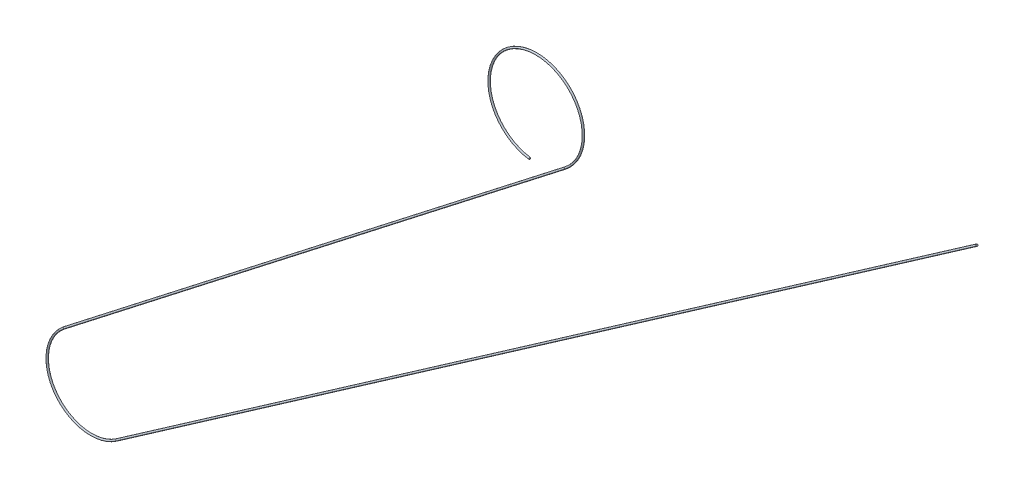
ISO-10303-21;
HEADER;
FILE_DESCRIPTION(('STEP AP214'),'2;1');
FILE_NAME('part.step','',(''),(''),'','','');
FILE_SCHEMA(('AUTOMOTIVE_DESIGN { 1 0 10303 214 1 1 1 1 }'));
ENDSEC;
DATA;
#1=APPLICATION_CONTEXT('core data for automotive mechanical design processes');
#2=APPLICATION_PROTOCOL_DEFINITION('international standard','automotive_design',2000,#1);
#3=PRODUCT_CONTEXT('',#1,'mechanical');
#4=PRODUCT('Part','Part','',(#3));
#5=PRODUCT_RELATED_PRODUCT_CATEGORY('part','',(#4));
#6=PRODUCT_DEFINITION_FORMATION('','',#4);
#7=PRODUCT_DEFINITION_CONTEXT('part definition',#1,'design');
#8=PRODUCT_DEFINITION('design','',#6,#7);
#9=PRODUCT_DEFINITION_SHAPE('','',#8);
#10=(LENGTH_UNIT() NAMED_UNIT(*) SI_UNIT(.MILLI.,.METRE.));
#11=(NAMED_UNIT(*) PLANE_ANGLE_UNIT() SI_UNIT($,.RADIAN.));
#12=(NAMED_UNIT(*) SI_UNIT($,.STERADIAN.) SOLID_ANGLE_UNIT());
#13=UNCERTAINTY_MEASURE_WITH_UNIT(LENGTH_MEASURE(1.E-05),#10,'distance_accuracy_value','');
#14=(GEOMETRIC_REPRESENTATION_CONTEXT(3) GLOBAL_UNCERTAINTY_ASSIGNED_CONTEXT((#13)) GLOBAL_UNIT_ASSIGNED_CONTEXT((#10,
#11,#12)) REPRESENTATION_CONTEXT('',''));
#15=CARTESIAN_POINT('',(0.,0.,0.));
#16=DIRECTION('',(0.,0.,1.));
#17=DIRECTION('',(1.,0.,0.));
#18=AXIS2_PLACEMENT_3D('',#15,#16,#17);
#19=CARTESIAN_POINT('',(-1249.96317616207,-288.929952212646,0.));
#20=DIRECTION('',(0.,0.,1.));
#21=DIRECTION('',(1.,0.,0.));
#22=AXIS2_PLACEMENT_3D('',#19,#20,#21);
#23=TOROIDAL_SURFACE('',#22,133.8,2.5);
#24=CARTESIAN_POINT('',(-1167.91298345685,-394.619146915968,0.));
#25=DIRECTION('',(-0.78990429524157,-0.61323013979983,0.));
#26=DIRECTION('',(0.61323013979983,-0.78990429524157,0.));
#27=AXIS2_PLACEMENT_3D('',#24,#25,#26);
#28=CIRCLE('',#27,2.5);
#29=CARTESIAN_POINT('',(-1166.37990810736,-396.593907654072,0.));
#30=VERTEX_POINT('',#29);
#31=EDGE_CURVE('E39',#30,#30,#28,.T.);
#32=CARTESIAN_POINT('',(-1268.45419749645,-421.446072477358,0.));
#33=DIRECTION('',(-0.990404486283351,0.138198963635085,0.));
#34=DIRECTION('',(-0.138198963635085,-0.990404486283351,0.));
#35=AXIS2_PLACEMENT_3D('',#32,#33,#34);
#36=CIRCLE('',#35,2.5);
#37=CARTESIAN_POINT('',(-1268.79969490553,-423.922083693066,0.));
#38=VERTEX_POINT('',#37);
#39=EDGE_CURVE('E10',#38,#38,#36,.T.);
#40=CARTESIAN_POINT('',(-1249.96317616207,-288.929952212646,0.));
#41=DIRECTION('',(0.,0.,1.));
#42=DIRECTION('',(1.,0.,0.));
#43=AXIS2_PLACEMENT_3D('',#40,#41,#42);
#44=CIRCLE('',#43,136.3);
#45=EDGE_CURVE('',#30,#38,#44,.T.);
#46=ORIENTED_EDGE('',*,*,#31,.F.);
#47=ORIENTED_EDGE('',*,*,#39,.T.);
#48=ORIENTED_EDGE('',*,*,#45,.T.);
#49=ORIENTED_EDGE('',*,*,#45,.F.);
#50=EDGE_LOOP('',(#46,#48,#47,#49));
#51=FACE_BOUND('',#50,.T.);
#52=ADVANCED_FACE('F33',(#51),#23,.T.);
#53=CARTESIAN_POINT('',(-2588.86674291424,-1497.75490375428,0.));
#54=DIRECTION('',(0.789904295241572,0.613230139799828,0.));
#55=DIRECTION('',(-0.613230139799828,0.789904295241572,0.));
#56=AXIS2_PLACEMENT_3D('',#53,#54,#55);
#57=CYLINDRICAL_SURFACE('',#56,2.5);
#58=CARTESIAN_POINT('',(-2588.86674291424,-1497.75490375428,0.));
#59=DIRECTION('',(-0.78990429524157,-0.61323013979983,0.));
#60=DIRECTION('',(0.61323013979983,-0.78990429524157,0.));
#61=AXIS2_PLACEMENT_3D('',#58,#59,#60);
#62=CIRCLE('',#61,2.5);
#63=CARTESIAN_POINT('',(-2590.39981826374,-1495.78014301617,0.));
#64=VERTEX_POINT('',#63);
#65=EDGE_CURVE('E43',#64,#64,#62,.T.);
#66=ORIENTED_EDGE('',*,*,#65,.F.);
#67=EDGE_LOOP('',(#66));
#68=FACE_BOUND('',#67,.T.);
#69=ORIENTED_EDGE('',*,*,#31,.T.);
#70=EDGE_LOOP('',(#69));
#71=FACE_BOUND('',#70,.T.);
#72=ADVANCED_FACE('F62',(#68,#71),#57,.T.);
#73=CARTESIAN_POINT('',(-2512.21297543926,-1596.49294065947,0.));
#74=DIRECTION('',(0.,0.,-1.));
#75=DIRECTION('',(-1.,0.,0.));
#76=AXIS2_PLACEMENT_3D('',#73,#74,#75);
#77=TOROIDAL_SURFACE('',#76,125.,2.5);
#78=CARTESIAN_POINT('',(-2440.79770029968,-1699.0836735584,0.));
#79=DIRECTION('',(0.820725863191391,0.571322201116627,0.));
#80=DIRECTION('',(-0.571322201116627,0.820725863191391,0.));
#81=AXIS2_PLACEMENT_3D('',#78,#79,#80);
#82=CIRCLE('',#81,2.5);
#83=CARTESIAN_POINT('',(-2439.36939479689,-1701.13548821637,0.));
#84=VERTEX_POINT('',#83);
#85=EDGE_CURVE('E47',#84,#84,#82,.T.);
#86=CARTESIAN_POINT('',(-2512.21297543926,-1596.49294065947,0.));
#87=DIRECTION('',(0.,0.,-1.));
#88=DIRECTION('',(-1.,0.,0.));
#89=AXIS2_PLACEMENT_3D('',#86,#87,#88);
#90=CIRCLE('',#89,127.5);
#91=EDGE_CURVE('',#84,#64,#90,.T.);
#92=ORIENTED_EDGE('',*,*,#85,.F.);
#93=ORIENTED_EDGE('',*,*,#65,.T.);
#94=ORIENTED_EDGE('',*,*,#91,.T.);
#95=ORIENTED_EDGE('',*,*,#91,.F.);
#96=EDGE_LOOP('',(#92,#94,#93,#95));
#97=FACE_BOUND('',#96,.T.);
#98=ADVANCED_FACE('F59',(#97),#77,.T.);
#99=CARTESIAN_POINT('',(-2440.79770029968,-1699.0836735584,0.));
#100=DIRECTION('',(0.820725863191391,0.571322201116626,0.));
#101=DIRECTION('',(-0.571322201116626,0.820725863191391,0.));
#102=AXIS2_PLACEMENT_3D('',#99,#100,#101);
#103=CYLINDRICAL_SURFACE('',#102,2.5);
#104=ORIENTED_EDGE('',*,*,#85,.T.);
#105=EDGE_LOOP('',(#104));
#106=FACE_BOUND('',#105,.T.);
#107=CARTESIAN_POINT('',(0.,0.,0.));
#108=DIRECTION('',(0.820725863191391,0.571322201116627,0.));
#109=DIRECTION('',(-0.571322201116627,0.820725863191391,0.));
#110=AXIS2_PLACEMENT_3D('',#107,#108,#109);
#111=CIRCLE('',#110,2.5);
#112=CARTESIAN_POINT('',(-1.42830550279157,2.05181465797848,0.));
#113=VERTEX_POINT('',#112);
#114=EDGE_CURVE('E50',#113,#113,#111,.T.);
#115=ORIENTED_EDGE('',*,*,#114,.F.);
#116=EDGE_LOOP('',(#115));
#117=FACE_BOUND('',#116,.T.);
#118=ADVANCED_FACE('F56',(#106,#117),#103,.T.);
#119=CARTESIAN_POINT('',(-1268.45419749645,-421.446072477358,0.));
#120=DIRECTION('',(-0.990404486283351,0.138198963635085,0.));
#121=DIRECTION('',(-0.138198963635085,-0.990404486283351,0.));
#122=AXIS2_PLACEMENT_3D('',#119,#120,#121);
#123=PLANE('',#122);
#124=ORIENTED_EDGE('',*,*,#39,.F.);
#125=EDGE_LOOP('',(#124));
#126=FACE_BOUND('',#125,.T.);
#127=ADVANCED_FACE('F74',(#126),#123,.F.);
#128=CARTESIAN_POINT('',(0.,0.,0.));
#129=DIRECTION('',(0.820725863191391,0.571322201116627,0.));
#130=DIRECTION('',(-0.571322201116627,0.820725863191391,0.));
#131=AXIS2_PLACEMENT_3D('',#128,#129,#130);
#132=PLANE('',#131);
#133=ORIENTED_EDGE('',*,*,#114,.T.);
#134=EDGE_LOOP('',(#133));
#135=FACE_BOUND('',#134,.T.);
#136=ADVANCED_FACE('F75',(#135),#132,.T.);
#137=CLOSED_SHELL('',(#52,#72,#98,#118,#127,#136));
#138=MANIFOLD_SOLID_BREP('B2',#137);
#139=ADVANCED_BREP_SHAPE_REPRESENTATION('',(#18,#138),#14);
#140=SHAPE_DEFINITION_REPRESENTATION(#9,#139);
ENDSEC;
END-ISO-10303-21;
